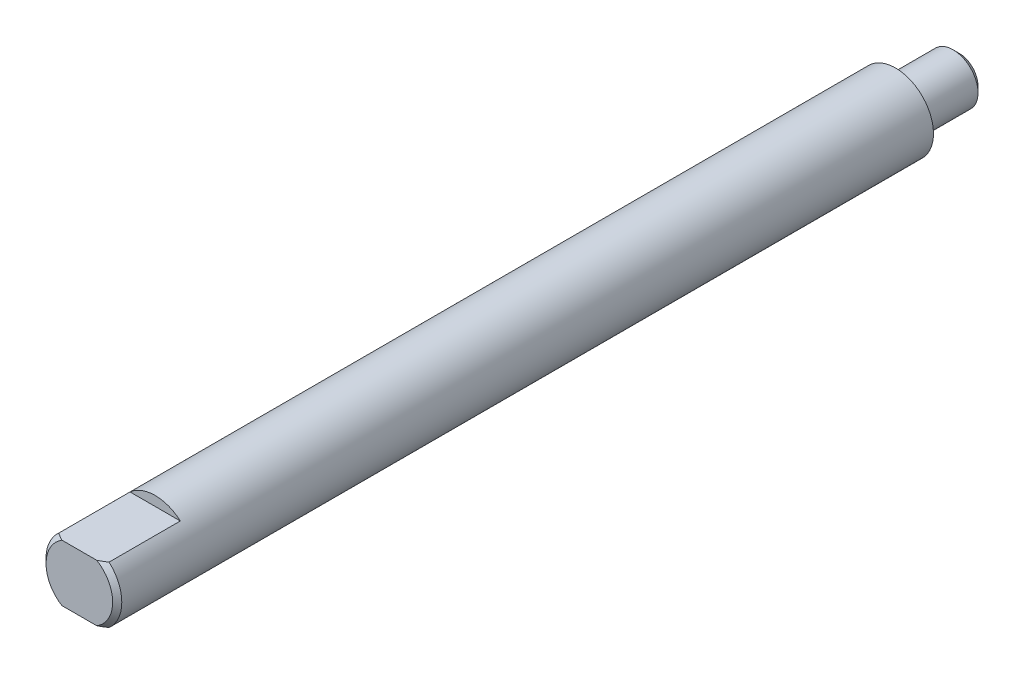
from build123d import *

# Parameters (mm, degrees)
SKETCH2_W          = 6.35
SKETCH2_H          = 0.8
CUT_EXTRUDE1_DEPTH = 5


with BuildPart() as part:
    # Sketch1 → Revolve1 (revolve)
    with BuildSketch(Plane(origin=(0, 0, 0), x_dir=(0, 0, -1), z_dir=(1, 0, 0)), mode=Mode.PRIVATE) as revolve1_sk:
        Polygon((69.6468, 1.57), (69.1368, 2.0828), (64.3128, 2.0828), (64.3128, 3.175), (-3.684, 3.175), (-4.064, 2.79), (-4.064, 0), (69.6468, 0), align=None)
    revolve(revolve1_sk.sketch.rotate(Axis((0, 0, 4.064), (0, 0, -1)), 180), axis=Axis((0, 0, 4.064), (0, 0, -1)))

    # Sketch2 → Cut-Extrude1 (cut, symmetric)
    with BuildSketch(Plane(origin=(0, 0, 0), x_dir=(0, 0, -1), z_dir=(1, 0, 0))):
        with Locations((-0.889, 2.775)):
            Rectangle(SKETCH2_W, SKETCH2_H)
        with Locations((-0.889, -2.775)):
            Rectangle(SKETCH2_W, SKETCH2_H)
    extrude(amount=CUT_EXTRUDE1_DEPTH, both=True, mode=Mode.SUBTRACT)


solid = part.part
